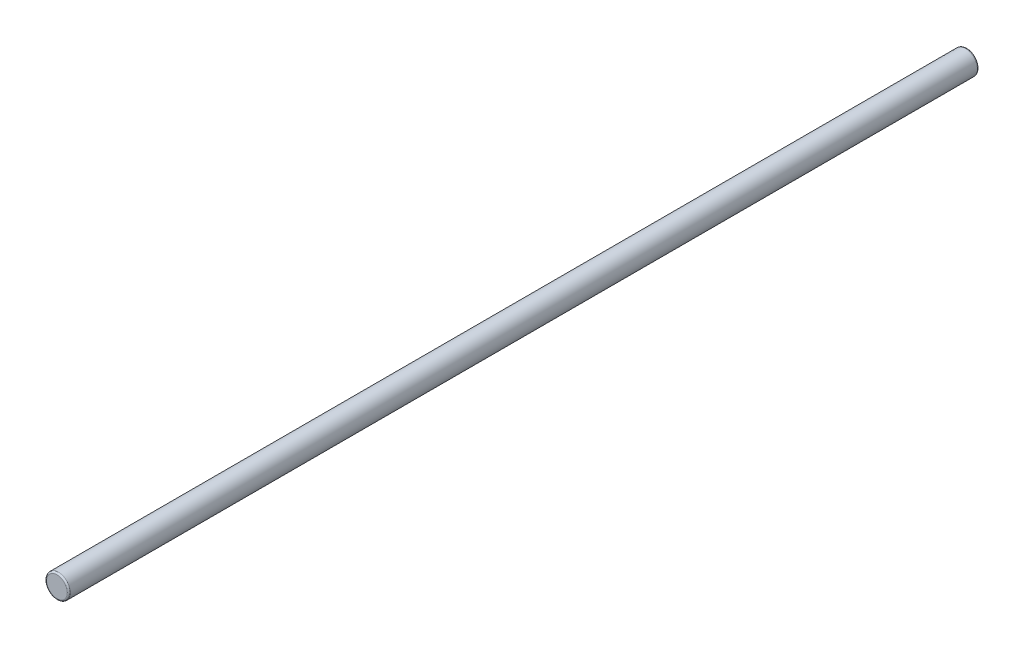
ISO-10303-21;
HEADER;
FILE_DESCRIPTION(('STEP AP214'),'2;1');
FILE_NAME('part.step','',(''),(''),'','','');
FILE_SCHEMA(('AUTOMOTIVE_DESIGN { 1 0 10303 214 1 1 1 1 }'));
ENDSEC;
DATA;
#1=APPLICATION_CONTEXT('core data for automotive mechanical design processes');
#2=APPLICATION_PROTOCOL_DEFINITION('international standard','automotive_design',2000,#1);
#3=PRODUCT_CONTEXT('',#1,'mechanical');
#4=PRODUCT('Part','Part','',(#3));
#5=PRODUCT_RELATED_PRODUCT_CATEGORY('part','',(#4));
#6=PRODUCT_DEFINITION_FORMATION('','',#4);
#7=PRODUCT_DEFINITION_CONTEXT('part definition',#1,'design');
#8=PRODUCT_DEFINITION('design','',#6,#7);
#9=PRODUCT_DEFINITION_SHAPE('','',#8);
#10=(LENGTH_UNIT() NAMED_UNIT(*) SI_UNIT(.MILLI.,.METRE.));
#11=(NAMED_UNIT(*) PLANE_ANGLE_UNIT() SI_UNIT($,.RADIAN.));
#12=(NAMED_UNIT(*) SI_UNIT($,.STERADIAN.) SOLID_ANGLE_UNIT());
#13=UNCERTAINTY_MEASURE_WITH_UNIT(LENGTH_MEASURE(1.E-05),#10,'distance_accuracy_value','');
#14=(GEOMETRIC_REPRESENTATION_CONTEXT(3) GLOBAL_UNCERTAINTY_ASSIGNED_CONTEXT((#13)) GLOBAL_UNIT_ASSIGNED_CONTEXT((#10,
#11,#12)) REPRESENTATION_CONTEXT('',''));
#15=CARTESIAN_POINT('',(0.,0.,0.));
#16=DIRECTION('',(0.,0.,1.));
#17=DIRECTION('',(1.,0.,0.));
#18=AXIS2_PLACEMENT_3D('',#15,#16,#17);
#19=CARTESIAN_POINT('',(0.,0.,-304.8));
#20=DIRECTION('',(0.,0.,1.));
#21=DIRECTION('',(1.,0.,0.));
#22=AXIS2_PLACEMENT_3D('',#19,#20,#21);
#23=CYLINDRICAL_SURFACE('',#22,3.96875);
#24=CARTESIAN_POINT('',(0.,0.,-0.508000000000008));
#25=DIRECTION('',(0.,0.,1.));
#26=DIRECTION('',(1.,0.,0.));
#27=AXIS2_PLACEMENT_3D('',#24,#25,#26);
#28=CIRCLE('',#27,3.96875);
#29=CARTESIAN_POINT('',(3.96875,0.,-0.508000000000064));
#30=VERTEX_POINT('',#29);
#31=EDGE_CURVE('E38',#30,#30,#28,.F.);
#32=CARTESIAN_POINT('',(0.,0.,-304.292));
#33=DIRECTION('',(0.,0.,1.));
#34=DIRECTION('',(1.,0.,0.));
#35=AXIS2_PLACEMENT_3D('',#32,#33,#34);
#36=CIRCLE('',#35,3.96875);
#37=CARTESIAN_POINT('',(3.96875,0.,-304.292));
#38=VERTEX_POINT('',#37);
#39=EDGE_CURVE('E42',#38,#38,#36,.T.);
#40=CARTESIAN_POINT('',(3.96875,0.,-0.508000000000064));
#41=CARTESIAN_POINT('',(3.96875,0.,-3.67241666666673));
#42=CARTESIAN_POINT('',(3.96875,0.,-6.8368333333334));
#43=CARTESIAN_POINT('',(3.96875,0.,-13.1656666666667));
#44=CARTESIAN_POINT('',(3.96875,0.,-16.3300833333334));
#45=CARTESIAN_POINT('',(3.96875,0.,-22.6589166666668));
#46=CARTESIAN_POINT('',(3.96875,0.,-25.8233333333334));
#47=CARTESIAN_POINT('',(3.96875,0.,-32.1521666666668));
#48=CARTESIAN_POINT('',(3.96875,0.,-35.3165833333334));
#49=CARTESIAN_POINT('',(3.96875,0.,-41.6454166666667));
#50=CARTESIAN_POINT('',(3.96875,0.,-44.8098333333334));
#51=CARTESIAN_POINT('',(3.96875,0.,-51.1386666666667));
#52=CARTESIAN_POINT('',(3.96875,0.,-54.3030833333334));
#53=CARTESIAN_POINT('',(3.96875,0.,-60.6319166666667));
#54=CARTESIAN_POINT('',(3.96875,0.,-63.7963333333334));
#55=CARTESIAN_POINT('',(3.96875,0.,-70.1251666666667));
#56=CARTESIAN_POINT('',(3.96875,0.,-73.2895833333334));
#57=CARTESIAN_POINT('',(3.96875,0.,-79.6184166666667));
#58=CARTESIAN_POINT('',(3.96875,0.,-82.7828333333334));
#59=CARTESIAN_POINT('',(3.96875,0.,-89.1116666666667));
#60=CARTESIAN_POINT('',(3.96875,0.,-92.2760833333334));
#61=CARTESIAN_POINT('',(3.96875,0.,-98.6049166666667));
#62=CARTESIAN_POINT('',(3.96875,0.,-101.769333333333));
#63=CARTESIAN_POINT('',(3.96875,0.,-108.098166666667));
#64=CARTESIAN_POINT('',(3.96875,0.,-111.262583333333));
#65=CARTESIAN_POINT('',(3.96875,0.,-117.591416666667));
#66=CARTESIAN_POINT('',(3.96875,0.,-120.755833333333));
#67=CARTESIAN_POINT('',(3.96875,0.,-127.084666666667));
#68=CARTESIAN_POINT('',(3.96875,0.,-130.249083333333));
#69=CARTESIAN_POINT('',(3.96875,0.,-136.577916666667));
#70=CARTESIAN_POINT('',(3.96875,0.,-139.742333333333));
#71=CARTESIAN_POINT('',(3.96875,0.,-146.071166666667));
#72=CARTESIAN_POINT('',(3.96875,0.,-149.235583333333));
#73=CARTESIAN_POINT('',(3.96875,0.,-155.564416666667));
#74=CARTESIAN_POINT('',(3.96875,0.,-158.728833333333));
#75=CARTESIAN_POINT('',(3.96875,0.,-165.057666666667));
#76=CARTESIAN_POINT('',(3.96875,0.,-168.222083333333));
#77=CARTESIAN_POINT('',(3.96875,0.,-174.550916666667));
#78=CARTESIAN_POINT('',(3.96875,0.,-177.715333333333));
#79=CARTESIAN_POINT('',(3.96875,0.,-184.044166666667));
#80=CARTESIAN_POINT('',(3.96875,0.,-187.208583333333));
#81=CARTESIAN_POINT('',(3.96875,0.,-193.537416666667));
#82=CARTESIAN_POINT('',(3.96875,0.,-196.701833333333));
#83=CARTESIAN_POINT('',(3.96875,0.,-203.030666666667));
#84=CARTESIAN_POINT('',(3.96875,0.,-206.195083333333));
#85=CARTESIAN_POINT('',(3.96875,0.,-212.523916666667));
#86=CARTESIAN_POINT('',(3.96875,0.,-215.688333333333));
#87=CARTESIAN_POINT('',(3.96875,0.,-222.017166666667));
#88=CARTESIAN_POINT('',(3.96875,0.,-225.181583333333));
#89=CARTESIAN_POINT('',(3.96875,0.,-231.510416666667));
#90=CARTESIAN_POINT('',(3.96875,0.,-234.674833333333));
#91=CARTESIAN_POINT('',(3.96875,0.,-241.003666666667));
#92=CARTESIAN_POINT('',(3.96875,0.,-244.168083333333));
#93=CARTESIAN_POINT('',(3.96875,0.,-250.496916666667));
#94=CARTESIAN_POINT('',(3.96875,0.,-253.661333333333));
#95=CARTESIAN_POINT('',(3.96875,0.,-259.990166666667));
#96=CARTESIAN_POINT('',(3.96875,0.,-263.154583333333));
#97=CARTESIAN_POINT('',(3.96875,0.,-269.483416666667));
#98=CARTESIAN_POINT('',(3.96875,0.,-272.647833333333));
#99=CARTESIAN_POINT('',(3.96875,0.,-278.976666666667));
#100=CARTESIAN_POINT('',(3.96875,0.,-282.141083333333));
#101=CARTESIAN_POINT('',(3.96875,0.,-288.469916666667));
#102=CARTESIAN_POINT('',(3.96875,0.,-291.634333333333));
#103=CARTESIAN_POINT('',(3.96875,0.,-297.963166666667));
#104=CARTESIAN_POINT('',(3.96875,0.,-301.127583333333));
#105=CARTESIAN_POINT('',(3.96875,0.,-304.292));
#106=B_SPLINE_CURVE_WITH_KNOTS('',3,(#40,#41,#42,#43,#44,#45,#46,#47,#48,#49,#50,#51,#52,#53,
#54,#55,#56,#57,#58,#59,#60,#61,#62,#63,#64,#65,#66,#67,#68,#69,#70,#71,#72,#73,#74,#75,#76,#77,
#78,#79,#80,#81,#82,#83,#84,#85,#86,#87,#88,#89,#90,#91,#92,#93,#94,#95,#96,#97,#98,#99,#100,
#101,#102,#103,#104,#105),.UNSPECIFIED.,.F.,.F.,(4,2,2,2,2,2,2,2,2,2,2,2,2,2,2,2,2,2,2,2,2,2,2,
2,2,2,2,2,2,2,2,2,4),(0.,9.49325000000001,18.9865,28.47975,37.973,47.46625,56.9595,66.45275,
75.946,85.43925,94.9325,104.42575,113.919,123.41225,132.9055,142.39875,151.892,161.38525,
170.8785,180.37175,189.865,199.35825,208.8515,218.34475,227.838,237.33125,246.8245,256.31775,
265.811,275.30425,284.7975,294.29075,303.784),.UNSPECIFIED.);
#107=EDGE_CURVE('BSEAM32',#30,#38,#106,.T.);
#108=ORIENTED_EDGE('',*,*,#31,.T.);
#109=ORIENTED_EDGE('',*,*,#39,.T.);
#110=ORIENTED_EDGE('',*,*,#107,.T.);
#111=ORIENTED_EDGE('',*,*,#107,.F.);
#112=EDGE_LOOP('',(#108,#110,#109,#111));
#113=FACE_BOUND('',#112,.T.);
#114=ADVANCED_FACE('F32',(#113),#23,.T.);
#115=CARTESIAN_POINT('',(0.,0.,-304.8));
#116=DIRECTION('',(0.,0.,1.));
#117=DIRECTION('',(1.,0.,0.));
#118=AXIS2_PLACEMENT_3D('',#115,#116,#117);
#119=PLANE('',#118);
#120=CARTESIAN_POINT('',(0.,0.,-304.8));
#121=DIRECTION('',(0.,0.,1.));
#122=DIRECTION('',(1.,0.,0.));
#123=AXIS2_PLACEMENT_3D('',#120,#121,#122);
#124=CIRCLE('',#123,3.46075);
#125=CARTESIAN_POINT('',(3.46075,0.,-304.8));
#126=VERTEX_POINT('',#125);
#127=EDGE_CURVE('E10',#126,#126,#124,.F.);
#128=ORIENTED_EDGE('',*,*,#127,.T.);
#129=EDGE_LOOP('',(#128));
#130=FACE_BOUND('',#129,.T.);
#131=ADVANCED_FACE('F65',(#130),#119,.F.);
#132=CARTESIAN_POINT('',(0.,0.,0.));
#133=DIRECTION('',(0.,0.,1.));
#134=DIRECTION('',(1.,0.,0.));
#135=AXIS2_PLACEMENT_3D('',#132,#133,#134);
#136=PLANE('',#135);
#137=CARTESIAN_POINT('',(0.,0.,0.));
#138=DIRECTION('',(0.,0.,1.));
#139=DIRECTION('',(1.,0.,0.));
#140=AXIS2_PLACEMENT_3D('',#137,#138,#139);
#141=CIRCLE('',#140,3.46075);
#142=CARTESIAN_POINT('',(3.46075,0.,0.));
#143=VERTEX_POINT('',#142);
#144=EDGE_CURVE('E46',#143,#143,#141,.T.);
#145=ORIENTED_EDGE('',*,*,#144,.T.);
#146=EDGE_LOOP('',(#145));
#147=FACE_BOUND('',#146,.T.);
#148=ADVANCED_FACE('F52',(#147),#136,.T.);
#149=CARTESIAN_POINT('',(0.,0.,-0.508000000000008));
#150=DIRECTION('',(0.,0.,1.));
#151=DIRECTION('',(1.,0.,0.));
#152=AXIS2_PLACEMENT_3D('',#149,#150,#151);
#153=TOROIDAL_SURFACE('',#152,3.46075,0.508);
#154=ORIENTED_EDGE('',*,*,#31,.F.);
#155=EDGE_LOOP('',(#154));
#156=FACE_BOUND('',#155,.T.);
#157=ORIENTED_EDGE('',*,*,#144,.F.);
#158=EDGE_LOOP('',(#157));
#159=FACE_BOUND('',#158,.T.);
#160=ADVANCED_FACE('F54',(#156,#159),#153,.T.);
#161=CARTESIAN_POINT('',(0.,0.,-304.292));
#162=DIRECTION('',(0.,0.,1.));
#163=DIRECTION('',(1.,0.,0.));
#164=AXIS2_PLACEMENT_3D('',#161,#162,#163);
#165=TOROIDAL_SURFACE('',#164,3.46075,0.508);
#166=ORIENTED_EDGE('',*,*,#127,.F.);
#167=EDGE_LOOP('',(#166));
#168=FACE_BOUND('',#167,.T.);
#169=ORIENTED_EDGE('',*,*,#39,.F.);
#170=EDGE_LOOP('',(#169));
#171=FACE_BOUND('',#170,.T.);
#172=ADVANCED_FACE('F56',(#168,#171),#165,.T.);
#173=CLOSED_SHELL('',(#114,#131,#148,#160,#172));
#174=MANIFOLD_SOLID_BREP('B2',#173);
#175=ADVANCED_BREP_SHAPE_REPRESENTATION('',(#18,#174),#14);
#176=SHAPE_DEFINITION_REPRESENTATION(#9,#175);
ENDSEC;
END-ISO-10303-21;
